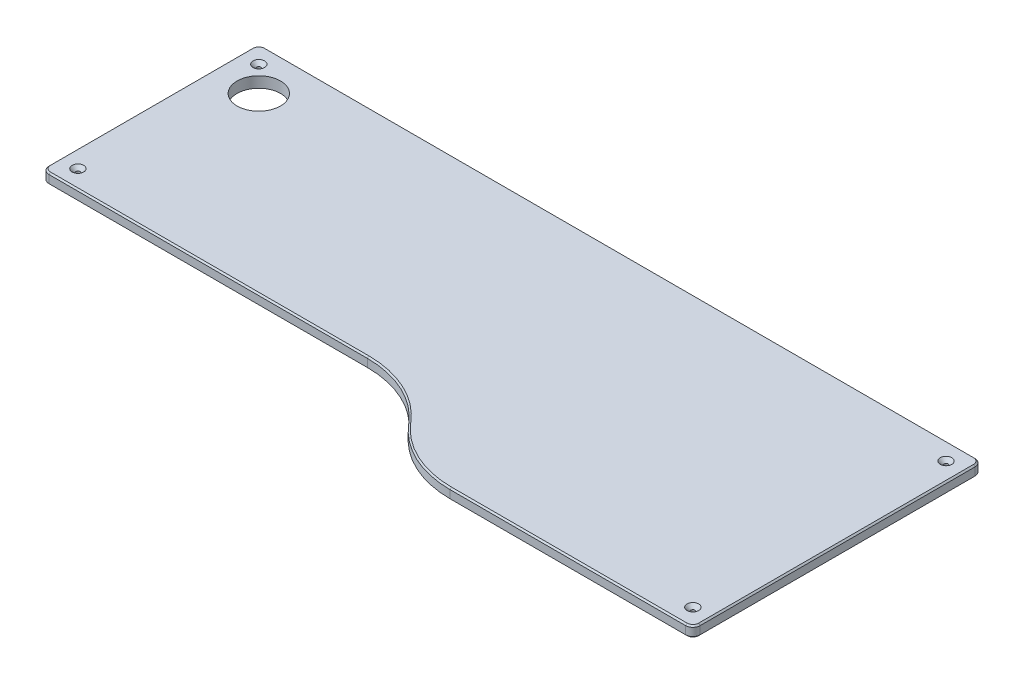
from build123d import *

# Parameters (mm, degrees)
SKETCH1_R           = 3
BOSS_EXTRUDE1_DEPTH = 15
CHAMFER1_SIZE       = 5
SKETCH2_R           = 2
CUT_EXTRUDE1_DEPTH  = 5
SKETCH3_R           = 30
CUT_EXTRUDE2_DEPTH  = 539.725347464
CHAMFER2_SIZE       = 2


with BuildPart() as part:
    # Sketch1 → Boss-Extrude1 (new body)
    with BuildSketch(Plane(origin=(0, 0, 0), x_dir=(1, 0, 0), z_dir=(0, 1, 0))):
        with BuildLine():
            Line((-490, 200), (490, 200))
            ThreePointArc((490, 200), (497.071067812, 197.071067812), (500, 190))
            Line((500, 190), (500, -190))
            ThreePointArc((500, -190), (497.071067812, -197.071067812), (490, -200))
            Line((490, -200), (164.476105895, -200))
            ThreePointArc((164.476105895, -200), (105.315308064, -186.885775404), (57.238052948, -150))
            ThreePointArc((57.238052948, -150), (9.160797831, -113.114224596), (-50, -100))
            Line((-50, -100), (-490, -100))
            ThreePointArc((-490, -100), (-497.071067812, -97.071067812), (-500, -90))
            Line((-500, -90), (-500, 190))
            ThreePointArc((-500, 190), (-497.071067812, 197.071067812), (-490, 200))
        make_face()
        with Locations(Location((-475, -75, 0), (0, 0, 270))):
            Circle(SKETCH1_R, mode=Mode.SUBTRACT)
        with Locations(Location((-475, 175, 0), (0, 0, 90))):
            Circle(SKETCH1_R, mode=Mode.SUBTRACT)
        with Locations(Location((475, 175, 0), (0, 0, 270))):
            Circle(SKETCH1_R, mode=Mode.SUBTRACT)
        with Locations(Location((475, -175, 0), (0, 0, 90))):
            Circle(SKETCH1_R, mode=Mode.SUBTRACT)
    extrude(amount=BOSS_EXTRUDE1_DEPTH)

    # Chamfer1
    chamfer1_edges = [part.edges().sort_by_distance(p)[0] for p in [
        (-475, 15, 72),
        (-475, 15, -172),
        (475, 15, -178),
        (475, 15, 178),
    ]]
    chamfer(chamfer1_edges, length=CHAMFER1_SIZE)

    # Sketch2 → Cut-Extrude1 (cut)
    with BuildSketch(Plane.XZ):
        with Locations(Location((168.5, 75, 0), (0, 0, 270))):
            Circle(SKETCH2_R)
        with Locations(Location((168.5, -75, 0), (0, 0, 90))):
            Circle(SKETCH2_R)
        with Locations(Location((472.5, -80, 0), (0, 0, 270))):
            Circle(SKETCH2_R)
        with Locations(Location((472.5, 70, 0), (0, 0, 90))):
            Circle(SKETCH2_R)
    extrude(amount=-CUT_EXTRUDE1_DEPTH, mode=Mode.SUBTRACT)

    # Sketch3 → Cut-Extrude2 (cut, through all)
    with BuildSketch(Plane(origin=(0, 15, 0), x_dir=(1, 0, 0), z_dir=(0, 1, 0))):
        with Locations(Location((-440, 140, 0), (0, 0, 270))):
            Circle(SKETCH3_R)
    extrude(amount=-CUT_EXTRUDE2_DEPTH, mode=Mode.SUBTRACT)

    # Chamfer2
    chamfer2_edges = [part.edges().sort_by_distance(p)[0] for p in [
        (327.238052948, 15, 200),
        (-270, 0, 100),
        (-497.071067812, 0, 97.071067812),
        (-500, 0, -50),
        (-497.071067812, 0, -197.071067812),
        (0, 0, -200),
        (497.071067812, 0, -197.071067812),
        (500, 0, 0),
        (497.071067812, 0, 197.071067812),
        (497.071067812, 15, 197.071067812),
        (327.238052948, 0, 200),
        (105.315308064, 0, 186.885775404),
        (9.160797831, 0, 113.114224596),
        (500, 15, 0),
        (497.071067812, 15, -197.071067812),
        (0, 15, -200),
        (-497.071067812, 15, -197.071067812),
        (-500, 15, -50),
        (-497.071067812, 15, 97.071067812),
        (-270, 15, 100),
        (9.160797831, 15, 113.114224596),
        (105.315308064, 15, 186.885775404),
    ]]
    chamfer(chamfer2_edges, length=CHAMFER2_SIZE)


solid = part.part
